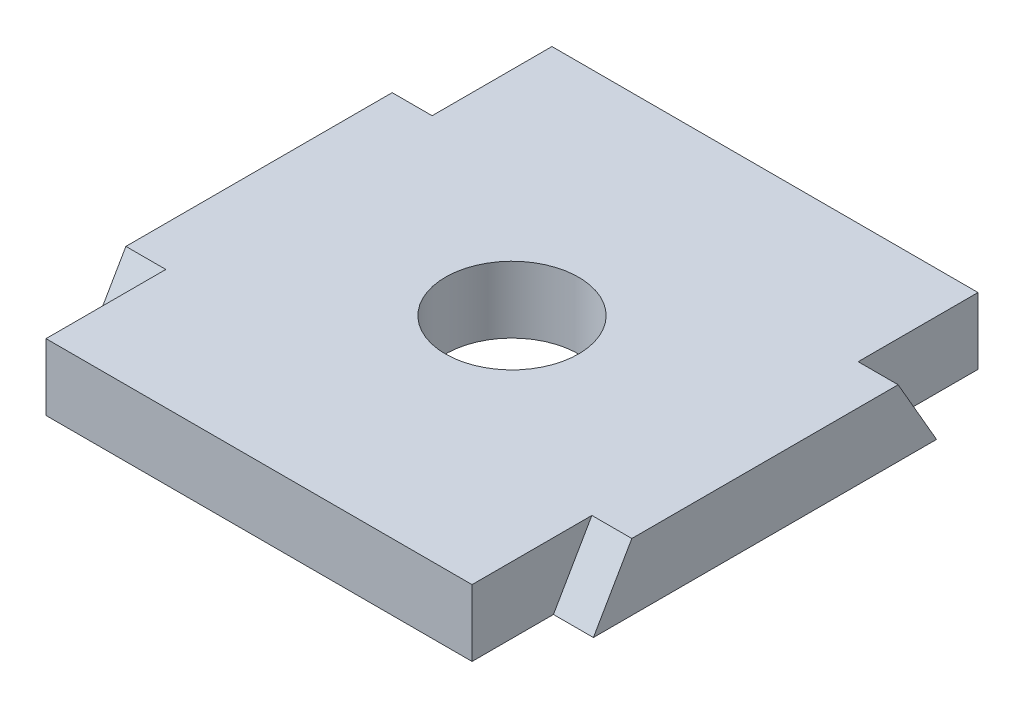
ISO-10303-21;
HEADER;
FILE_DESCRIPTION(('STEP AP214'),'2;1');
FILE_NAME('part.step','',(''),(''),'','','');
FILE_SCHEMA(('AUTOMOTIVE_DESIGN { 1 0 10303 214 1 1 1 1 }'));
ENDSEC;
DATA;
#1=APPLICATION_CONTEXT('core data for automotive mechanical design processes');
#2=APPLICATION_PROTOCOL_DEFINITION('international standard','automotive_design',2000,#1);
#3=PRODUCT_CONTEXT('',#1,'mechanical');
#4=PRODUCT('Part','Part','',(#3));
#5=PRODUCT_RELATED_PRODUCT_CATEGORY('part','',(#4));
#6=PRODUCT_DEFINITION_FORMATION('','',#4);
#7=PRODUCT_DEFINITION_CONTEXT('part definition',#1,'design');
#8=PRODUCT_DEFINITION('design','',#6,#7);
#9=PRODUCT_DEFINITION_SHAPE('','',#8);
#10=(LENGTH_UNIT() NAMED_UNIT(*) SI_UNIT(.MILLI.,.METRE.));
#11=(NAMED_UNIT(*) PLANE_ANGLE_UNIT() SI_UNIT($,.RADIAN.));
#12=(NAMED_UNIT(*) SI_UNIT($,.STERADIAN.) SOLID_ANGLE_UNIT());
#13=UNCERTAINTY_MEASURE_WITH_UNIT(LENGTH_MEASURE(1.E-05),#10,'distance_accuracy_value','');
#14=(GEOMETRIC_REPRESENTATION_CONTEXT(3) GLOBAL_UNCERTAINTY_ASSIGNED_CONTEXT((#13)) GLOBAL_UNIT_ASSIGNED_CONTEXT((#10,
#11,#12)) REPRESENTATION_CONTEXT('',''));
#15=CARTESIAN_POINT('',(0.,0.,0.));
#16=DIRECTION('',(0.,0.,1.));
#17=DIRECTION('',(1.,0.,0.));
#18=AXIS2_PLACEMENT_3D('',#15,#16,#17);
#19=CARTESIAN_POINT('',(35.,5.,0.));
#20=DIRECTION('',(0.,1.,0.));
#21=DIRECTION('',(0.,0.,1.));
#22=AXIS2_PLACEMENT_3D('',#19,#20,#21);
#23=PLANE('',#22);
#24=DIRECTION('',(1.,0.,0.));
#25=VECTOR('',#24,1.);
#26=CARTESIAN_POINT('',(0.,5.,-9.));
#27=LINE('',#26,#25);
#28=CARTESIAN_POINT('',(0.,5.,-9.));
#29=VERTEX_POINT('',#28);
#30=CARTESIAN_POINT('',(3.,5.,-9.));
#31=VERTEX_POINT('',#30);
#32=EDGE_CURVE('E160',#29,#31,#27,.T.);
#33=ORIENTED_EDGE('',*,*,#32,.T.);
#34=DIRECTION('',(0.,0.,1.));
#35=VECTOR('',#34,1.);
#36=CARTESIAN_POINT('',(3.,5.,0.));
#37=LINE('',#36,#35);
#38=CARTESIAN_POINT('',(3.,5.,0.));
#39=VERTEX_POINT('',#38);
#40=EDGE_CURVE('E52',#31,#39,#37,.T.);
#41=ORIENTED_EDGE('',*,*,#40,.T.);
#42=DIRECTION('',(1.,0.,0.));
#43=VECTOR('',#42,1.);
#44=CARTESIAN_POINT('',(3.,5.,0.));
#45=LINE('',#44,#43);
#46=CARTESIAN_POINT('',(35.,5.,0.));
#47=VERTEX_POINT('',#46);
#48=EDGE_CURVE('E205',#39,#47,#45,.T.);
#49=ORIENTED_EDGE('',*,*,#48,.T.);
#50=DIRECTION('',(0.,0.,-1.));
#51=VECTOR('',#50,1.);
#52=CARTESIAN_POINT('',(35.,5.,0.));
#53=LINE('',#52,#51);
#54=CARTESIAN_POINT('',(35.,5.,-9.));
#55=VERTEX_POINT('',#54);
#56=EDGE_CURVE('E136',#47,#55,#53,.T.);
#57=ORIENTED_EDGE('',*,*,#56,.T.);
#58=DIRECTION('',(1.,0.,0.));
#59=VECTOR('',#58,1.);
#60=CARTESIAN_POINT('',(35.,5.,-9.));
#61=LINE('',#60,#59);
#62=CARTESIAN_POINT('',(38.,5.,-9.));
#63=VERTEX_POINT('',#62);
#64=EDGE_CURVE('E124',#55,#63,#61,.T.);
#65=ORIENTED_EDGE('',*,*,#64,.T.);
#66=DIRECTION('',(0.,0.,-1.));
#67=VECTOR('',#66,1.);
#68=CARTESIAN_POINT('',(38.,5.,-9.));
#69=LINE('',#68,#67);
#70=CARTESIAN_POINT('',(38.,5.,-29.));
#71=VERTEX_POINT('',#70);
#72=EDGE_CURVE('E134',#63,#71,#69,.T.);
#73=ORIENTED_EDGE('',*,*,#72,.T.);
#74=DIRECTION('',(-1.,0.,0.));
#75=VECTOR('',#74,1.);
#76=CARTESIAN_POINT('',(35.,5.,-29.));
#77=LINE('',#76,#75);
#78=CARTESIAN_POINT('',(35.,5.,-29.));
#79=VERTEX_POINT('',#78);
#80=EDGE_CURVE('E142',#71,#79,#77,.T.);
#81=ORIENTED_EDGE('',*,*,#80,.T.);
#82=DIRECTION('',(0.,0.,-1.));
#83=VECTOR('',#82,1.);
#84=CARTESIAN_POINT('',(35.,5.,-29.));
#85=LINE('',#84,#83);
#86=CARTESIAN_POINT('',(35.,5.,-38.));
#87=VERTEX_POINT('',#86);
#88=EDGE_CURVE('E144',#79,#87,#85,.T.);
#89=ORIENTED_EDGE('',*,*,#88,.T.);
#90=DIRECTION('',(-1.,0.,0.));
#91=VECTOR('',#90,1.);
#92=CARTESIAN_POINT('',(3.,5.,-38.));
#93=LINE('',#92,#91);
#94=CARTESIAN_POINT('',(3.,5.,-38.));
#95=VERTEX_POINT('',#94);
#96=EDGE_CURVE('E149',#87,#95,#93,.T.);
#97=ORIENTED_EDGE('',*,*,#96,.T.);
#98=DIRECTION('',(0.,0.,1.));
#99=VECTOR('',#98,1.);
#100=CARTESIAN_POINT('',(3.,5.,-29.));
#101=LINE('',#100,#99);
#102=CARTESIAN_POINT('',(3.,5.,-29.));
#103=VERTEX_POINT('',#102);
#104=EDGE_CURVE('E151',#95,#103,#101,.T.);
#105=ORIENTED_EDGE('',*,*,#104,.T.);
#106=DIRECTION('',(-1.,0.,0.));
#107=VECTOR('',#106,1.);
#108=CARTESIAN_POINT('',(0.,5.,-29.));
#109=LINE('',#108,#107);
#110=CARTESIAN_POINT('',(0.,5.,-29.));
#111=VERTEX_POINT('',#110);
#112=EDGE_CURVE('E154',#103,#111,#109,.T.);
#113=ORIENTED_EDGE('',*,*,#112,.T.);
#114=DIRECTION('',(0.,0.,1.));
#115=VECTOR('',#114,1.);
#116=CARTESIAN_POINT('',(0.,5.,-9.));
#117=LINE('',#116,#115);
#118=EDGE_CURVE('E157',#111,#29,#117,.T.);
#119=ORIENTED_EDGE('',*,*,#118,.T.);
#120=EDGE_LOOP('',(#33,#41,#49,#57,#65,#73,#81,#89,#97,#105,#113,#119));
#121=FACE_BOUND('',#120,.T.);
#122=CARTESIAN_POINT('',(19.,5.,-19.));
#123=DIRECTION('',(0.,1.,0.));
#124=DIRECTION('',(0.,0.,1.));
#125=AXIS2_PLACEMENT_3D('',#122,#123,#124);
#126=CIRCLE('',#125,5.);
#127=CARTESIAN_POINT('',(19.,5.,-14.));
#128=VERTEX_POINT('',#127);
#129=EDGE_CURVE('E184',#128,#128,#126,.T.);
#130=ORIENTED_EDGE('',*,*,#129,.F.);
#131=EDGE_LOOP('',(#130));
#132=FACE_BOUND('',#131,.T.);
#133=ADVANCED_FACE('F30',(#121,#132),#23,.T.);
#134=CARTESIAN_POINT('',(35.,0.,0.));
#135=DIRECTION('',(0.,1.,0.));
#136=DIRECTION('',(0.,0.,1.));
#137=AXIS2_PLACEMENT_3D('',#134,#135,#136);
#138=PLANE('',#137);
#139=DIRECTION('',(1.,0.,0.));
#140=VECTOR('',#139,1.);
#141=CARTESIAN_POINT('',(0.,0.,-6.1132486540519));
#142=LINE('',#141,#140);
#143=CARTESIAN_POINT('',(35.,0.,-6.1132486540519));
#144=VERTEX_POINT('',#143);
#145=CARTESIAN_POINT('',(38.,0.,-6.1132486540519));
#146=VERTEX_POINT('',#145);
#147=EDGE_CURVE('E127',#144,#146,#142,.T.);
#148=ORIENTED_EDGE('',*,*,#147,.F.);
#149=DIRECTION('',(0.,0.,-1.));
#150=VECTOR('',#149,1.);
#151=CARTESIAN_POINT('',(35.,0.,0.));
#152=LINE('',#151,#150);
#153=CARTESIAN_POINT('',(35.,0.,0.));
#154=VERTEX_POINT('',#153);
#155=EDGE_CURVE('E177',#154,#144,#152,.T.);
#156=ORIENTED_EDGE('',*,*,#155,.F.);
#157=DIRECTION('',(1.,0.,0.));
#158=VECTOR('',#157,1.);
#159=CARTESIAN_POINT('',(3.,0.,0.));
#160=LINE('',#159,#158);
#161=CARTESIAN_POINT('',(3.,0.,0.));
#162=VERTEX_POINT('',#161);
#163=EDGE_CURVE('E181',#162,#154,#160,.T.);
#164=ORIENTED_EDGE('',*,*,#163,.F.);
#165=DIRECTION('',(0.,0.,1.));
#166=VECTOR('',#165,1.);
#167=CARTESIAN_POINT('',(3.,0.,0.));
#168=LINE('',#167,#166);
#169=CARTESIAN_POINT('',(3.,0.,-6.1132486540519));
#170=VERTEX_POINT('',#169);
#171=EDGE_CURVE('E203',#170,#162,#168,.T.);
#172=ORIENTED_EDGE('',*,*,#171,.F.);
#173=CARTESIAN_POINT('',(0.,0.,-6.1132486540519));
#174=VERTEX_POINT('',#173);
#175=EDGE_CURVE('E45',#174,#170,#142,.T.);
#176=ORIENTED_EDGE('',*,*,#175,.F.);
#177=DIRECTION('',(0.,0.,1.));
#178=VECTOR('',#177,1.);
#179=CARTESIAN_POINT('',(0.,0.,-9.));
#180=LINE('',#179,#178);
#181=CARTESIAN_POINT('',(0.,0.,-31.8867513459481));
#182=VERTEX_POINT('',#181);
#183=EDGE_CURVE('E201',#182,#174,#180,.T.);
#184=ORIENTED_EDGE('',*,*,#183,.F.);
#185=DIRECTION('',(1.,0.,0.));
#186=VECTOR('',#185,1.);
#187=CARTESIAN_POINT('',(0.,0.,-31.8867513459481));
#188=LINE('',#187,#186);
#189=CARTESIAN_POINT('',(3.,0.,-31.8867513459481));
#190=VERTEX_POINT('',#189);
#191=EDGE_CURVE('E225',#182,#190,#188,.T.);
#192=ORIENTED_EDGE('',*,*,#191,.T.);
#193=DIRECTION('',(0.,0.,1.));
#194=VECTOR('',#193,1.);
#195=CARTESIAN_POINT('',(3.,0.,-29.));
#196=LINE('',#195,#194);
#197=CARTESIAN_POINT('',(3.,0.,-38.));
#198=VERTEX_POINT('',#197);
#199=EDGE_CURVE('E198',#198,#190,#196,.T.);
#200=ORIENTED_EDGE('',*,*,#199,.F.);
#201=DIRECTION('',(-1.,0.,0.));
#202=VECTOR('',#201,1.);
#203=CARTESIAN_POINT('',(3.,0.,-38.));
#204=LINE('',#203,#202);
#205=CARTESIAN_POINT('',(35.,0.,-38.));
#206=VERTEX_POINT('',#205);
#207=EDGE_CURVE('E196',#206,#198,#204,.T.);
#208=ORIENTED_EDGE('',*,*,#207,.F.);
#209=DIRECTION('',(0.,0.,-1.));
#210=VECTOR('',#209,1.);
#211=CARTESIAN_POINT('',(35.,0.,-29.));
#212=LINE('',#211,#210);
#213=CARTESIAN_POINT('',(35.,0.,-31.8867513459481));
#214=VERTEX_POINT('',#213);
#215=EDGE_CURVE('E194',#214,#206,#212,.T.);
#216=ORIENTED_EDGE('',*,*,#215,.F.);
#217=CARTESIAN_POINT('',(38.,0.,-31.8867513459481));
#218=VERTEX_POINT('',#217);
#219=EDGE_CURVE('E224',#214,#218,#188,.T.);
#220=ORIENTED_EDGE('',*,*,#219,.T.);
#221=DIRECTION('',(0.,0.,-1.));
#222=VECTOR('',#221,1.);
#223=CARTESIAN_POINT('',(38.,0.,-9.));
#224=LINE('',#223,#222);
#225=EDGE_CURVE('E186',#146,#218,#224,.T.);
#226=ORIENTED_EDGE('',*,*,#225,.F.);
#227=EDGE_LOOP('',(#148,#156,#164,#172,#176,#184,#192,#200,#208,#216,#220,#226));
#228=FACE_BOUND('',#227,.T.);
#229=CARTESIAN_POINT('',(19.,0.,-19.));
#230=DIRECTION('',(0.,1.,0.));
#231=DIRECTION('',(0.,0.,1.));
#232=AXIS2_PLACEMENT_3D('',#229,#230,#231);
#233=CIRCLE('',#232,5.);
#234=CARTESIAN_POINT('',(19.,0.,-14.));
#235=VERTEX_POINT('',#234);
#236=EDGE_CURVE('E189',#235,#235,#233,.T.);
#237=ORIENTED_EDGE('',*,*,#236,.T.);
#238=EDGE_LOOP('',(#237));
#239=FACE_BOUND('',#238,.T.);
#240=ADVANCED_FACE('F208',(#228,#239),#138,.F.);
#241=CARTESIAN_POINT('',(3.,5.,0.));
#242=DIRECTION('',(0.,0.,-1.));
#243=DIRECTION('',(-1.,0.,0.));
#244=AXIS2_PLACEMENT_3D('',#241,#242,#243);
#245=PLANE('',#244);
#246=ORIENTED_EDGE('',*,*,#163,.T.);
#247=DIRECTION('',(0.,-1.,0.));
#248=VECTOR('',#247,1.);
#249=CARTESIAN_POINT('',(35.,5.,0.));
#250=LINE('',#249,#248);
#251=EDGE_CURVE('E38',#47,#154,#250,.T.);
#252=ORIENTED_EDGE('',*,*,#251,.F.);
#253=ORIENTED_EDGE('',*,*,#48,.F.);
#254=DIRECTION('',(0.,-1.,0.));
#255=VECTOR('',#254,1.);
#256=CARTESIAN_POINT('',(3.,5.,0.));
#257=LINE('',#256,#255);
#258=EDGE_CURVE('E163',#39,#162,#257,.T.);
#259=ORIENTED_EDGE('',*,*,#258,.T.);
#260=EDGE_LOOP('',(#246,#252,#253,#259));
#261=FACE_BOUND('',#260,.T.);
#262=ADVANCED_FACE('F32',(#261),#245,.F.);
#263=CARTESIAN_POINT('',(35.,5.,0.));
#264=DIRECTION('',(-1.,0.,0.));
#265=DIRECTION('',(0.,0.,1.));
#266=AXIS2_PLACEMENT_3D('',#263,#264,#265);
#267=PLANE('',#266);
#268=ORIENTED_EDGE('',*,*,#155,.T.);
#269=DIRECTION('',(0.,0.866025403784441,-0.499999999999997));
#270=VECTOR('',#269,1.);
#271=CARTESIAN_POINT('',(35.,1.10288568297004,-6.75000000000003));
#272=LINE('',#271,#270);
#273=EDGE_CURVE('E212',#144,#55,#272,.T.);
#274=ORIENTED_EDGE('',*,*,#273,.T.);
#275=ORIENTED_EDGE('',*,*,#56,.F.);
#276=ORIENTED_EDGE('',*,*,#251,.T.);
#277=EDGE_LOOP('',(#268,#274,#275,#276));
#278=FACE_BOUND('',#277,.T.);
#279=ADVANCED_FACE('F176',(#278),#267,.F.);
#280=CARTESIAN_POINT('',(38.,5.,-9.));
#281=DIRECTION('',(-1.,0.,0.));
#282=DIRECTION('',(0.,0.,1.));
#283=AXIS2_PLACEMENT_3D('',#280,#281,#282);
#284=PLANE('',#283);
#285=ORIENTED_EDGE('',*,*,#225,.T.);
#286=DIRECTION('',(0.,0.86602540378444,0.499999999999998));
#287=VECTOR('',#286,1.);
#288=CARTESIAN_POINT('',(38.,5.,-29.));
#289=LINE('',#288,#287);
#290=EDGE_CURVE('E141',#218,#71,#289,.T.);
#291=ORIENTED_EDGE('',*,*,#290,.T.);
#292=ORIENTED_EDGE('',*,*,#72,.F.);
#293=DIRECTION('',(0.,-0.866025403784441,0.499999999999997));
#294=VECTOR('',#293,1.);
#295=CARTESIAN_POINT('',(38.,5.,-9.));
#296=LINE('',#295,#294);
#297=EDGE_CURVE('E121',#63,#146,#296,.T.);
#298=ORIENTED_EDGE('',*,*,#297,.T.);
#299=EDGE_LOOP('',(#285,#291,#292,#298));
#300=FACE_BOUND('',#299,.T.);
#301=ADVANCED_FACE('F139',(#300),#284,.F.);
#302=CARTESIAN_POINT('',(35.,5.,-29.));
#303=DIRECTION('',(-1.,0.,0.));
#304=DIRECTION('',(0.,0.,1.));
#305=AXIS2_PLACEMENT_3D('',#302,#303,#304);
#306=PLANE('',#305);
#307=ORIENTED_EDGE('',*,*,#88,.F.);
#308=DIRECTION('',(0.,-0.86602540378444,-0.499999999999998));
#309=VECTOR('',#308,1.);
#310=CARTESIAN_POINT('',(35.,5.,-29.));
#311=LINE('',#310,#309);
#312=EDGE_CURVE('E230',#79,#214,#311,.T.);
#313=ORIENTED_EDGE('',*,*,#312,.T.);
#314=ORIENTED_EDGE('',*,*,#215,.T.);
#315=DIRECTION('',(0.,-1.,0.));
#316=VECTOR('',#315,1.);
#317=CARTESIAN_POINT('',(35.,5.,-38.));
#318=LINE('',#317,#316);
#319=EDGE_CURVE('E169',#87,#206,#318,.T.);
#320=ORIENTED_EDGE('',*,*,#319,.F.);
#321=EDGE_LOOP('',(#307,#313,#314,#320));
#322=FACE_BOUND('',#321,.T.);
#323=ADVANCED_FACE('F265',(#322),#306,.F.);
#324=CARTESIAN_POINT('',(3.,5.,-38.));
#325=DIRECTION('',(0.,0.,1.));
#326=DIRECTION('',(1.,0.,0.));
#327=AXIS2_PLACEMENT_3D('',#324,#325,#326);
#328=PLANE('',#327);
#329=ORIENTED_EDGE('',*,*,#207,.T.);
#330=DIRECTION('',(0.,-1.,0.));
#331=VECTOR('',#330,1.);
#332=CARTESIAN_POINT('',(3.,5.,-38.));
#333=LINE('',#332,#331);
#334=EDGE_CURVE('E166',#95,#198,#333,.T.);
#335=ORIENTED_EDGE('',*,*,#334,.F.);
#336=ORIENTED_EDGE('',*,*,#96,.F.);
#337=ORIENTED_EDGE('',*,*,#319,.T.);
#338=EDGE_LOOP('',(#329,#335,#336,#337));
#339=FACE_BOUND('',#338,.T.);
#340=ADVANCED_FACE('F261',(#339),#328,.F.);
#341=CARTESIAN_POINT('',(3.,5.,-29.));
#342=DIRECTION('',(1.,0.,0.));
#343=DIRECTION('',(0.,0.,-1.));
#344=AXIS2_PLACEMENT_3D('',#341,#342,#343);
#345=PLANE('',#344);
#346=ORIENTED_EDGE('',*,*,#199,.T.);
#347=DIRECTION('',(0.,0.86602540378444,0.499999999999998));
#348=VECTOR('',#347,1.);
#349=CARTESIAN_POINT('',(3.,5.,-29.));
#350=LINE('',#349,#348);
#351=EDGE_CURVE('E227',#190,#103,#350,.T.);
#352=ORIENTED_EDGE('',*,*,#351,.T.);
#353=ORIENTED_EDGE('',*,*,#104,.F.);
#354=ORIENTED_EDGE('',*,*,#334,.T.);
#355=EDGE_LOOP('',(#346,#352,#353,#354));
#356=FACE_BOUND('',#355,.T.);
#357=ADVANCED_FACE('F258',(#356),#345,.F.);
#358=CARTESIAN_POINT('',(0.,5.,-9.));
#359=DIRECTION('',(1.,0.,0.));
#360=DIRECTION('',(0.,0.,-1.));
#361=AXIS2_PLACEMENT_3D('',#358,#359,#360);
#362=PLANE('',#361);
#363=ORIENTED_EDGE('',*,*,#183,.T.);
#364=DIRECTION('',(0.,-0.866025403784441,0.499999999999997));
#365=VECTOR('',#364,1.);
#366=CARTESIAN_POINT('',(0.,5.,-9.));
#367=LINE('',#366,#365);
#368=EDGE_CURVE('E130',#29,#174,#367,.T.);
#369=ORIENTED_EDGE('',*,*,#368,.F.);
#370=ORIENTED_EDGE('',*,*,#118,.F.);
#371=DIRECTION('',(0.,0.86602540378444,0.499999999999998));
#372=VECTOR('',#371,1.);
#373=CARTESIAN_POINT('',(0.,5.,-29.));
#374=LINE('',#373,#372);
#375=EDGE_CURVE('E222',#182,#111,#374,.T.);
#376=ORIENTED_EDGE('',*,*,#375,.F.);
#377=EDGE_LOOP('',(#363,#369,#370,#376));
#378=FACE_BOUND('',#377,.T.);
#379=ADVANCED_FACE('F247',(#378),#362,.F.);
#380=CARTESIAN_POINT('',(3.,5.,0.));
#381=DIRECTION('',(1.,0.,0.));
#382=DIRECTION('',(0.,0.,-1.));
#383=AXIS2_PLACEMENT_3D('',#380,#381,#382);
#384=PLANE('',#383);
#385=ORIENTED_EDGE('',*,*,#40,.F.);
#386=DIRECTION('',(0.,-0.866025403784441,0.499999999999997));
#387=VECTOR('',#386,1.);
#388=CARTESIAN_POINT('',(3.,1.10288568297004,-6.75000000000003));
#389=LINE('',#388,#387);
#390=EDGE_CURVE('E11',#31,#170,#389,.T.);
#391=ORIENTED_EDGE('',*,*,#390,.T.);
#392=ORIENTED_EDGE('',*,*,#171,.T.);
#393=ORIENTED_EDGE('',*,*,#258,.F.);
#394=EDGE_LOOP('',(#385,#391,#392,#393));
#395=FACE_BOUND('',#394,.T.);
#396=ADVANCED_FACE('F207',(#395),#384,.F.);
#397=CARTESIAN_POINT('',(19.,5.,-19.));
#398=DIRECTION('',(0.,-1.,0.));
#399=DIRECTION('',(0.,0.,-1.));
#400=AXIS2_PLACEMENT_3D('',#397,#398,#399);
#401=CYLINDRICAL_SURFACE('',#400,5.);
#402=ORIENTED_EDGE('',*,*,#129,.T.);
#403=EDGE_LOOP('',(#402));
#404=FACE_BOUND('',#403,.T.);
#405=ORIENTED_EDGE('',*,*,#236,.F.);
#406=EDGE_LOOP('',(#405));
#407=FACE_BOUND('',#406,.T.);
#408=ADVANCED_FACE('F235',(#404,#407),#401,.F.);
#409=CARTESIAN_POINT('',(0.,5.,-29.));
#410=DIRECTION('',(0.,0.499999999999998,-0.86602540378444));
#411=DIRECTION('',(0.,0.86602540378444,0.499999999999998));
#412=AXIS2_PLACEMENT_3D('',#409,#410,#411);
#413=PLANE('',#412);
#414=ORIENTED_EDGE('',*,*,#351,.F.);
#415=ORIENTED_EDGE('',*,*,#191,.F.);
#416=ORIENTED_EDGE('',*,*,#375,.T.);
#417=ORIENTED_EDGE('',*,*,#112,.F.);
#418=EDGE_LOOP('',(#414,#415,#416,#417));
#419=FACE_BOUND('',#418,.T.);
#420=ADVANCED_FACE('F237',(#419),#413,.T.);
#421=ORIENTED_EDGE('',*,*,#312,.F.);
#422=ORIENTED_EDGE('',*,*,#80,.F.);
#423=ORIENTED_EDGE('',*,*,#290,.F.);
#424=ORIENTED_EDGE('',*,*,#219,.F.);
#425=EDGE_LOOP('',(#421,#422,#423,#424));
#426=FACE_BOUND('',#425,.T.);
#427=ADVANCED_FACE('F244',(#426),#413,.T.);
#428=CARTESIAN_POINT('',(0.,5.,-9.));
#429=DIRECTION('',(0.,0.499999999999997,0.866025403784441));
#430=DIRECTION('',(0.,-0.866025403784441,0.499999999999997));
#431=AXIS2_PLACEMENT_3D('',#428,#429,#430);
#432=PLANE('',#431);
#433=ORIENTED_EDGE('',*,*,#390,.F.);
#434=ORIENTED_EDGE('',*,*,#32,.F.);
#435=ORIENTED_EDGE('',*,*,#368,.T.);
#436=ORIENTED_EDGE('',*,*,#175,.T.);
#437=EDGE_LOOP('',(#433,#434,#435,#436));
#438=FACE_BOUND('',#437,.T.);
#439=ADVANCED_FACE('F215',(#438),#432,.T.);
#440=ORIENTED_EDGE('',*,*,#273,.F.);
#441=ORIENTED_EDGE('',*,*,#147,.T.);
#442=ORIENTED_EDGE('',*,*,#297,.F.);
#443=ORIENTED_EDGE('',*,*,#64,.F.);
#444=EDGE_LOOP('',(#440,#441,#442,#443));
#445=FACE_BOUND('',#444,.T.);
#446=ADVANCED_FACE('F123',(#445),#432,.T.);
#447=CLOSED_SHELL('',(#133,#240,#262,#279,#301,#323,#340,#357,#379,#396,#408,#420,#427,#439,#446));
#448=MANIFOLD_SOLID_BREP('B2',#447);
#449=ADVANCED_BREP_SHAPE_REPRESENTATION('',(#18,#448),#14);
#450=SHAPE_DEFINITION_REPRESENTATION(#9,#449);
ENDSEC;
END-ISO-10303-21;
